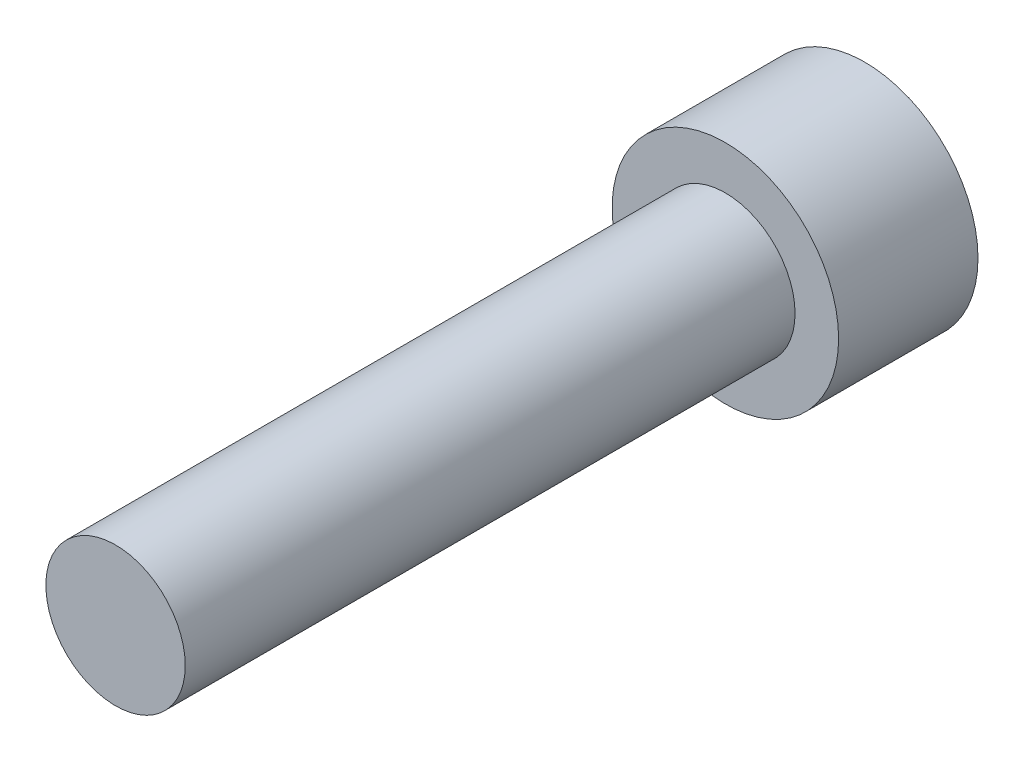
ISO-10303-21;
HEADER;
FILE_DESCRIPTION(('STEP AP214'),'2;1');
FILE_NAME('part.step','',(''),(''),'','','');
FILE_SCHEMA(('AUTOMOTIVE_DESIGN { 1 0 10303 214 1 1 1 1 }'));
ENDSEC;
DATA;
#1=APPLICATION_CONTEXT('core data for automotive mechanical design processes');
#2=APPLICATION_PROTOCOL_DEFINITION('international standard','automotive_design',2000,#1);
#3=PRODUCT_CONTEXT('',#1,'mechanical');
#4=PRODUCT('Part','Part','',(#3));
#5=PRODUCT_RELATED_PRODUCT_CATEGORY('part','',(#4));
#6=PRODUCT_DEFINITION_FORMATION('','',#4);
#7=PRODUCT_DEFINITION_CONTEXT('part definition',#1,'design');
#8=PRODUCT_DEFINITION('design','',#6,#7);
#9=PRODUCT_DEFINITION_SHAPE('','',#8);
#10=(LENGTH_UNIT() NAMED_UNIT(*) SI_UNIT(.MILLI.,.METRE.));
#11=(NAMED_UNIT(*) PLANE_ANGLE_UNIT() SI_UNIT($,.RADIAN.));
#12=(NAMED_UNIT(*) SI_UNIT($,.STERADIAN.) SOLID_ANGLE_UNIT());
#13=UNCERTAINTY_MEASURE_WITH_UNIT(LENGTH_MEASURE(1.E-05),#10,'distance_accuracy_value','');
#14=(GEOMETRIC_REPRESENTATION_CONTEXT(3) GLOBAL_UNCERTAINTY_ASSIGNED_CONTEXT((#13)) GLOBAL_UNIT_ASSIGNED_CONTEXT((#10,
#11,#12)) REPRESENTATION_CONTEXT('',''));
#15=CARTESIAN_POINT('',(0.,0.,0.));
#16=DIRECTION('',(0.,0.,1.));
#17=DIRECTION('',(1.,0.,0.));
#18=AXIS2_PLACEMENT_3D('',#15,#16,#17);
#19=CARTESIAN_POINT('',(0.,0.,35.));
#20=DIRECTION('',(0.,0.,1.));
#21=DIRECTION('',(1.,0.,0.));
#22=AXIS2_PLACEMENT_3D('',#19,#20,#21);
#23=PLANE('',#22);
#24=CARTESIAN_POINT('',(0.,0.,35.));
#25=DIRECTION('',(0.,0.,1.));
#26=DIRECTION('',(1.,0.,0.));
#27=AXIS2_PLACEMENT_3D('',#24,#25,#26);
#28=CIRCLE('',#27,4.);
#29=CARTESIAN_POINT('',(4.,0.,35.));
#30=VERTEX_POINT('',#29);
#31=EDGE_CURVE('E11',#30,#30,#28,.T.);
#32=ORIENTED_EDGE('',*,*,#31,.T.);
#33=EDGE_LOOP('',(#32));
#34=FACE_BOUND('',#33,.T.);
#35=ADVANCED_FACE('F32',(#34),#23,.T.);
#36=CARTESIAN_POINT('',(0.,0.,35.));
#37=DIRECTION('',(0.,0.,1.));
#38=DIRECTION('',(1.,0.,0.));
#39=AXIS2_PLACEMENT_3D('',#36,#37,#38);
#40=CYLINDRICAL_SURFACE('',#39,4.);
#41=CARTESIAN_POINT('',(0.,0.,0.));
#42=DIRECTION('',(0.,0.,1.));
#43=DIRECTION('',(1.,0.,0.));
#44=AXIS2_PLACEMENT_3D('',#41,#42,#43);
#45=CIRCLE('',#44,4.);
#46=CARTESIAN_POINT('',(4.,0.,0.));
#47=VERTEX_POINT('',#46);
#48=EDGE_CURVE('E39',#47,#47,#45,.T.);
#49=ORIENTED_EDGE('',*,*,#48,.T.);
#50=EDGE_LOOP('',(#49));
#51=FACE_BOUND('',#50,.T.);
#52=ORIENTED_EDGE('',*,*,#31,.F.);
#53=EDGE_LOOP('',(#52));
#54=FACE_BOUND('',#53,.T.);
#55=ADVANCED_FACE('F146',(#51,#54),#40,.T.);
#56=CARTESIAN_POINT('',(0.,-4.,0.));
#57=DIRECTION('',(0.,0.,1.));
#58=DIRECTION('',(1.,0.,0.));
#59=AXIS2_PLACEMENT_3D('',#56,#57,#58);
#60=PLANE('',#59);
#61=CARTESIAN_POINT('',(0.,0.,0.));
#62=DIRECTION('',(0.,0.,1.));
#63=DIRECTION('',(1.,0.,0.));
#64=AXIS2_PLACEMENT_3D('',#61,#62,#63);
#65=CIRCLE('',#64,6.5);
#66=CARTESIAN_POINT('',(6.5,0.,0.));
#67=VERTEX_POINT('',#66);
#68=EDGE_CURVE('E141',#67,#67,#65,.T.);
#69=ORIENTED_EDGE('',*,*,#68,.T.);
#70=EDGE_LOOP('',(#69));
#71=FACE_BOUND('',#70,.T.);
#72=ORIENTED_EDGE('',*,*,#48,.F.);
#73=EDGE_LOOP('',(#72));
#74=FACE_BOUND('',#73,.T.);
#75=ADVANCED_FACE('F149',(#71,#74),#60,.T.);
#76=CARTESIAN_POINT('',(0.,0.,35.));
#77=DIRECTION('',(0.,0.,1.));
#78=DIRECTION('',(1.,0.,0.));
#79=AXIS2_PLACEMENT_3D('',#76,#77,#78);
#80=CYLINDRICAL_SURFACE('',#79,6.5);
#81=CARTESIAN_POINT('',(0.,0.,-8.));
#82=DIRECTION('',(0.,0.,1.));
#83=DIRECTION('',(1.,0.,0.));
#84=AXIS2_PLACEMENT_3D('',#81,#82,#83);
#85=CIRCLE('',#84,6.5);
#86=CARTESIAN_POINT('',(6.5,0.,-8.));
#87=VERTEX_POINT('',#86);
#88=EDGE_CURVE('E133',#87,#87,#85,.T.);
#89=ORIENTED_EDGE('',*,*,#88,.T.);
#90=EDGE_LOOP('',(#89));
#91=FACE_BOUND('',#90,.T.);
#92=ORIENTED_EDGE('',*,*,#68,.F.);
#93=EDGE_LOOP('',(#92));
#94=FACE_BOUND('',#93,.T.);
#95=ADVANCED_FACE('F151',(#91,#94),#80,.T.);
#96=CARTESIAN_POINT('',(0.,-6.5,-8.));
#97=DIRECTION('',(0.,0.,-1.));
#98=DIRECTION('',(-1.,0.,0.));
#99=AXIS2_PLACEMENT_3D('',#96,#97,#98);
#100=PLANE('',#99);
#101=DIRECTION('',(0.866025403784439,-0.5,0.));
#102=VECTOR('',#101,1.);
#103=CARTESIAN_POINT('',(0.,3.46410161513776,-8.));
#104=LINE('',#103,#102);
#105=CARTESIAN_POINT('',(0.,3.46410161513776,-8.));
#106=VERTEX_POINT('',#105);
#107=CARTESIAN_POINT('',(3.,1.73205080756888,-8.));
#108=VERTEX_POINT('',#107);
#109=EDGE_CURVE('E46',#106,#108,#104,.T.);
#110=ORIENTED_EDGE('',*,*,#109,.F.);
#111=DIRECTION('',(0.866025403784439,0.5,0.));
#112=VECTOR('',#111,1.);
#113=CARTESIAN_POINT('',(-3.,1.73205080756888,-8.));
#114=LINE('',#113,#112);
#115=CARTESIAN_POINT('',(-3.,1.73205080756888,-8.));
#116=VERTEX_POINT('',#115);
#117=EDGE_CURVE('E129',#116,#106,#114,.T.);
#118=ORIENTED_EDGE('',*,*,#117,.F.);
#119=DIRECTION('',(0.,1.,0.));
#120=VECTOR('',#119,1.);
#121=CARTESIAN_POINT('',(-3.,-1.73205080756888,-8.));
#122=LINE('',#121,#120);
#123=CARTESIAN_POINT('',(-3.,-1.73205080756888,-8.));
#124=VERTEX_POINT('',#123);
#125=EDGE_CURVE('E127',#124,#116,#122,.T.);
#126=ORIENTED_EDGE('',*,*,#125,.F.);
#127=DIRECTION('',(-0.866025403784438,0.5,0.));
#128=VECTOR('',#127,1.);
#129=CARTESIAN_POINT('',(0.,-3.46410161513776,-8.));
#130=LINE('',#129,#128);
#131=CARTESIAN_POINT('',(0.,-3.46410161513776,-8.));
#132=VERTEX_POINT('',#131);
#133=EDGE_CURVE('E94',#132,#124,#130,.T.);
#134=ORIENTED_EDGE('',*,*,#133,.F.);
#135=DIRECTION('',(-0.866025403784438,-0.5,0.));
#136=VECTOR('',#135,1.);
#137=CARTESIAN_POINT('',(3.,-1.73205080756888,-8.));
#138=LINE('',#137,#136);
#139=CARTESIAN_POINT('',(3.,-1.73205080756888,-8.));
#140=VERTEX_POINT('',#139);
#141=EDGE_CURVE('E123',#140,#132,#138,.T.);
#142=ORIENTED_EDGE('',*,*,#141,.F.);
#143=DIRECTION('',(0.,-1.,0.));
#144=VECTOR('',#143,1.);
#145=CARTESIAN_POINT('',(3.,1.73205080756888,-8.));
#146=LINE('',#145,#144);
#147=EDGE_CURVE('E120',#108,#140,#146,.T.);
#148=ORIENTED_EDGE('',*,*,#147,.F.);
#149=EDGE_LOOP('',(#110,#118,#126,#134,#142,#148));
#150=FACE_BOUND('',#149,.T.);
#151=ORIENTED_EDGE('',*,*,#88,.F.);
#152=EDGE_LOOP('',(#151));
#153=FACE_BOUND('',#152,.T.);
#154=ADVANCED_FACE('F158',(#150,#153),#100,.T.);
#155=CARTESIAN_POINT('',(0.,3.46410161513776,-2.));
#156=DIRECTION('',(0.5,0.866025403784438,0.));
#157=DIRECTION('',(-0.866025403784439,0.5,0.));
#158=AXIS2_PLACEMENT_3D('',#155,#156,#157);
#159=PLANE('',#158);
#160=ORIENTED_EDGE('',*,*,#109,.T.);
#161=DIRECTION('',(0.,0.,-1.));
#162=VECTOR('',#161,1.);
#163=CARTESIAN_POINT('',(3.,1.73205080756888,-2.));
#164=LINE('',#163,#162);
#165=CARTESIAN_POINT('',(3.,1.73205080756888,-2.));
#166=VERTEX_POINT('',#165);
#167=EDGE_CURVE('E76',#166,#108,#164,.T.);
#168=ORIENTED_EDGE('',*,*,#167,.F.);
#169=DIRECTION('',(0.866025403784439,-0.5,0.));
#170=VECTOR('',#169,1.);
#171=CARTESIAN_POINT('',(0.,3.46410161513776,-2.));
#172=LINE('',#171,#170);
#173=CARTESIAN_POINT('',(0.,3.46410161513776,-2.));
#174=VERTEX_POINT('',#173);
#175=EDGE_CURVE('E131',#174,#166,#172,.T.);
#176=ORIENTED_EDGE('',*,*,#175,.F.);
#177=DIRECTION('',(0.,0.,-1.));
#178=VECTOR('',#177,1.);
#179=CARTESIAN_POINT('',(0.,3.46410161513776,-2.));
#180=LINE('',#179,#178);
#181=EDGE_CURVE('E54',#174,#106,#180,.T.);
#182=ORIENTED_EDGE('',*,*,#181,.T.);
#183=EDGE_LOOP('',(#160,#168,#176,#182));
#184=FACE_BOUND('',#183,.T.);
#185=ADVANCED_FACE('F189',(#184),#159,.F.);
#186=CARTESIAN_POINT('',(-3.,1.73205080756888,-2.));
#187=DIRECTION('',(-0.5,0.866025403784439,0.));
#188=DIRECTION('',(-0.866025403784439,-0.5,0.));
#189=AXIS2_PLACEMENT_3D('',#186,#187,#188);
#190=PLANE('',#189);
#191=ORIENTED_EDGE('',*,*,#117,.T.);
#192=ORIENTED_EDGE('',*,*,#181,.F.);
#193=DIRECTION('',(0.866025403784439,0.5,0.));
#194=VECTOR('',#193,1.);
#195=CARTESIAN_POINT('',(-3.,1.73205080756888,-2.));
#196=LINE('',#195,#194);
#197=CARTESIAN_POINT('',(-3.,1.73205080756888,-2.));
#198=VERTEX_POINT('',#197);
#199=EDGE_CURVE('E106',#198,#174,#196,.T.);
#200=ORIENTED_EDGE('',*,*,#199,.F.);
#201=DIRECTION('',(0.,0.,-1.));
#202=VECTOR('',#201,1.);
#203=CARTESIAN_POINT('',(-3.,1.73205080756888,-2.));
#204=LINE('',#203,#202);
#205=EDGE_CURVE('E98',#198,#116,#204,.T.);
#206=ORIENTED_EDGE('',*,*,#205,.T.);
#207=EDGE_LOOP('',(#191,#192,#200,#206));
#208=FACE_BOUND('',#207,.T.);
#209=ADVANCED_FACE('F199',(#208),#190,.F.);
#210=CARTESIAN_POINT('',(-3.,-1.73205080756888,-2.));
#211=DIRECTION('',(-1.,0.,0.));
#212=DIRECTION('',(0.,-1.,0.));
#213=AXIS2_PLACEMENT_3D('',#210,#211,#212);
#214=PLANE('',#213);
#215=ORIENTED_EDGE('',*,*,#125,.T.);
#216=ORIENTED_EDGE('',*,*,#205,.F.);
#217=DIRECTION('',(0.,1.,0.));
#218=VECTOR('',#217,1.);
#219=CARTESIAN_POINT('',(-3.,-1.73205080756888,-2.));
#220=LINE('',#219,#218);
#221=CARTESIAN_POINT('',(-3.,-1.73205080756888,-2.));
#222=VERTEX_POINT('',#221);
#223=EDGE_CURVE('E102',#222,#198,#220,.T.);
#224=ORIENTED_EDGE('',*,*,#223,.F.);
#225=DIRECTION('',(0.,0.,-1.));
#226=VECTOR('',#225,1.);
#227=CARTESIAN_POINT('',(-3.,-1.73205080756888,-2.));
#228=LINE('',#227,#226);
#229=EDGE_CURVE('E87',#222,#124,#228,.T.);
#230=ORIENTED_EDGE('',*,*,#229,.T.);
#231=EDGE_LOOP('',(#215,#216,#224,#230));
#232=FACE_BOUND('',#231,.T.);
#233=ADVANCED_FACE('F103',(#232),#214,.F.);
#234=CARTESIAN_POINT('',(0.,-3.46410161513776,-2.));
#235=DIRECTION('',(-0.5,-0.866025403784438,0.));
#236=DIRECTION('',(0.866025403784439,-0.5,0.));
#237=AXIS2_PLACEMENT_3D('',#234,#235,#236);
#238=PLANE('',#237);
#239=ORIENTED_EDGE('',*,*,#133,.T.);
#240=ORIENTED_EDGE('',*,*,#229,.F.);
#241=DIRECTION('',(-0.866025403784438,0.5,0.));
#242=VECTOR('',#241,1.);
#243=CARTESIAN_POINT('',(0.,-3.46410161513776,-2.));
#244=LINE('',#243,#242);
#245=CARTESIAN_POINT('',(0.,-3.46410161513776,-2.));
#246=VERTEX_POINT('',#245);
#247=EDGE_CURVE('E91',#246,#222,#244,.T.);
#248=ORIENTED_EDGE('',*,*,#247,.F.);
#249=DIRECTION('',(0.,0.,-1.));
#250=VECTOR('',#249,1.);
#251=CARTESIAN_POINT('',(0.,-3.46410161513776,-2.));
#252=LINE('',#251,#250);
#253=EDGE_CURVE('E99',#246,#132,#252,.T.);
#254=ORIENTED_EDGE('',*,*,#253,.T.);
#255=EDGE_LOOP('',(#239,#240,#248,#254));
#256=FACE_BOUND('',#255,.T.);
#257=ADVANCED_FACE('F89',(#256),#238,.F.);
#258=CARTESIAN_POINT('',(3.,-1.73205080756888,-2.));
#259=DIRECTION('',(0.5,-0.866025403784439,0.));
#260=DIRECTION('',(0.866025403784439,0.5,0.));
#261=AXIS2_PLACEMENT_3D('',#258,#259,#260);
#262=PLANE('',#261);
#263=ORIENTED_EDGE('',*,*,#141,.T.);
#264=ORIENTED_EDGE('',*,*,#253,.F.);
#265=DIRECTION('',(-0.866025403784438,-0.5,0.));
#266=VECTOR('',#265,1.);
#267=CARTESIAN_POINT('',(3.,-1.73205080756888,-2.));
#268=LINE('',#267,#266);
#269=CARTESIAN_POINT('',(3.,-1.73205080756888,-2.));
#270=VERTEX_POINT('',#269);
#271=EDGE_CURVE('E112',#270,#246,#268,.T.);
#272=ORIENTED_EDGE('',*,*,#271,.F.);
#273=DIRECTION('',(0.,0.,-1.));
#274=VECTOR('',#273,1.);
#275=CARTESIAN_POINT('',(3.,-1.73205080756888,-2.));
#276=LINE('',#275,#274);
#277=EDGE_CURVE('E136',#270,#140,#276,.T.);
#278=ORIENTED_EDGE('',*,*,#277,.T.);
#279=EDGE_LOOP('',(#263,#264,#272,#278));
#280=FACE_BOUND('',#279,.T.);
#281=ADVANCED_FACE('F224',(#280),#262,.F.);
#282=CARTESIAN_POINT('',(3.,1.73205080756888,-2.));
#283=DIRECTION('',(1.,0.,0.));
#284=DIRECTION('',(0.,0.,-1.));
#285=AXIS2_PLACEMENT_3D('',#282,#283,#284);
#286=PLANE('',#285);
#287=ORIENTED_EDGE('',*,*,#147,.T.);
#288=ORIENTED_EDGE('',*,*,#277,.F.);
#289=DIRECTION('',(0.,-1.,0.));
#290=VECTOR('',#289,1.);
#291=CARTESIAN_POINT('',(3.,1.73205080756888,-2.));
#292=LINE('',#291,#290);
#293=EDGE_CURVE('E114',#166,#270,#292,.T.);
#294=ORIENTED_EDGE('',*,*,#293,.F.);
#295=ORIENTED_EDGE('',*,*,#167,.T.);
#296=EDGE_LOOP('',(#287,#288,#294,#295));
#297=FACE_BOUND('',#296,.T.);
#298=ADVANCED_FACE('F233',(#297),#286,.F.);
#299=CARTESIAN_POINT('',(6.,0.,-2.));
#300=DIRECTION('',(0.,0.,-1.));
#301=DIRECTION('',(-1.,0.,0.));
#302=AXIS2_PLACEMENT_3D('',#299,#300,#301);
#303=PLANE('',#302);
#304=ORIENTED_EDGE('',*,*,#175,.T.);
#305=ORIENTED_EDGE('',*,*,#293,.T.);
#306=ORIENTED_EDGE('',*,*,#271,.T.);
#307=ORIENTED_EDGE('',*,*,#247,.T.);
#308=ORIENTED_EDGE('',*,*,#223,.T.);
#309=ORIENTED_EDGE('',*,*,#199,.T.);
#310=EDGE_LOOP('',(#304,#305,#306,#307,#308,#309));
#311=FACE_BOUND('',#310,.T.);
#312=ADVANCED_FACE('F109',(#311),#303,.T.);
#313=CLOSED_SHELL('',(#35,#55,#75,#95,#154,#185,#209,#233,#257,#281,#298,#312));
#314=MANIFOLD_SOLID_BREP('B2',#313);
#315=ADVANCED_BREP_SHAPE_REPRESENTATION('',(#18,#314),#14);
#316=SHAPE_DEFINITION_REPRESENTATION(#9,#315);
ENDSEC;
END-ISO-10303-21;
